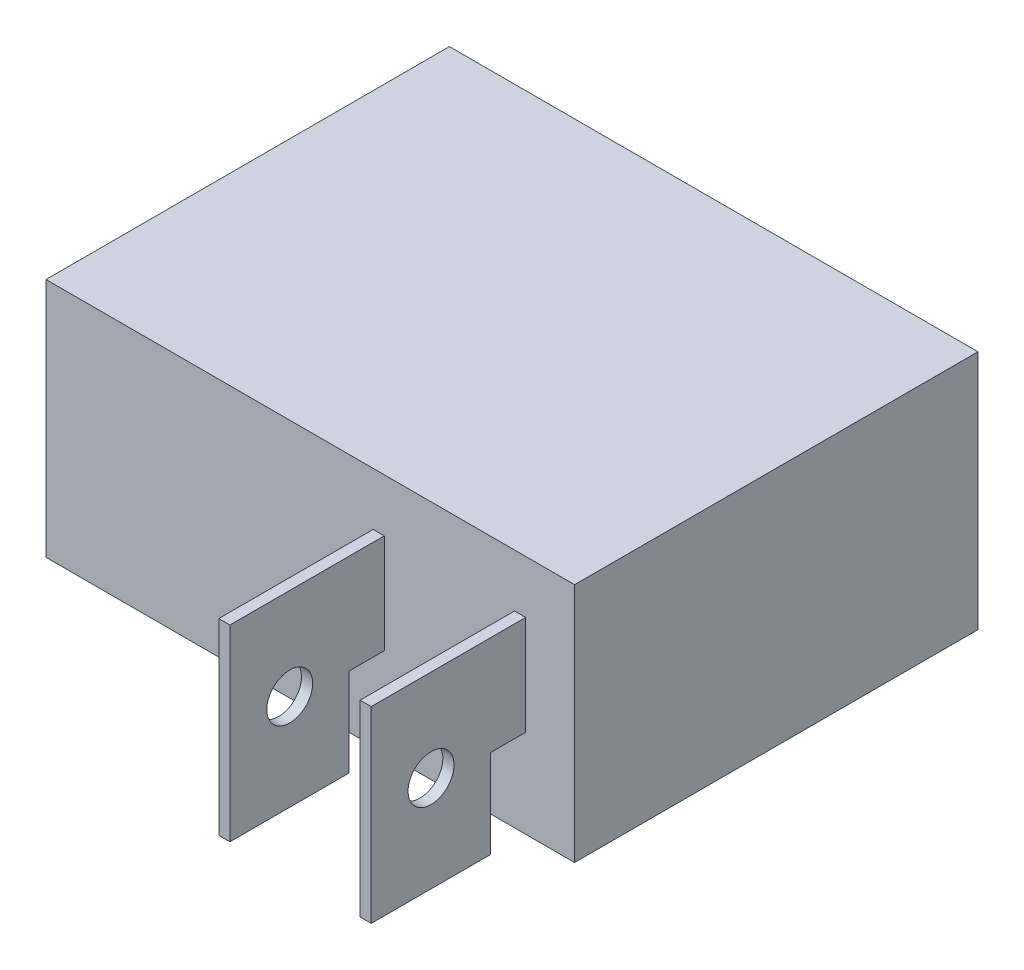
ISO-10303-21;
HEADER;
FILE_DESCRIPTION(('STEP AP214'),'2;1');
FILE_NAME('part.step','',(''),(''),'','','');
FILE_SCHEMA(('AUTOMOTIVE_DESIGN { 1 0 10303 214 1 1 1 1 }'));
ENDSEC;
DATA;
#1=APPLICATION_CONTEXT('core data for automotive mechanical design processes');
#2=APPLICATION_PROTOCOL_DEFINITION('international standard','automotive_design',2000,#1);
#3=PRODUCT_CONTEXT('',#1,'mechanical');
#4=PRODUCT('Part','Part','',(#3));
#5=PRODUCT_RELATED_PRODUCT_CATEGORY('part','',(#4));
#6=PRODUCT_DEFINITION_FORMATION('','',#4);
#7=PRODUCT_DEFINITION_CONTEXT('part definition',#1,'design');
#8=PRODUCT_DEFINITION('design','',#6,#7);
#9=PRODUCT_DEFINITION_SHAPE('','',#8);
#10=(LENGTH_UNIT() NAMED_UNIT(*) SI_UNIT(.MILLI.,.METRE.));
#11=(NAMED_UNIT(*) PLANE_ANGLE_UNIT() SI_UNIT($,.RADIAN.));
#12=(NAMED_UNIT(*) SI_UNIT($,.STERADIAN.) SOLID_ANGLE_UNIT());
#13=UNCERTAINTY_MEASURE_WITH_UNIT(LENGTH_MEASURE(1.E-05),#10,'distance_accuracy_value','');
#14=(GEOMETRIC_REPRESENTATION_CONTEXT(3) GLOBAL_UNCERTAINTY_ASSIGNED_CONTEXT((#13)) GLOBAL_UNIT_ASSIGNED_CONTEXT((#10,
#11,#12)) REPRESENTATION_CONTEXT('',''));
#15=CARTESIAN_POINT('',(0.,0.,0.));
#16=DIRECTION('',(0.,0.,1.));
#17=DIRECTION('',(1.,0.,0.));
#18=AXIS2_PLACEMENT_3D('',#15,#16,#17);
#19=CARTESIAN_POINT('',(-19.,17.3,14.5));
#20=DIRECTION('',(0.,0.,-1.));
#21=DIRECTION('',(-1.,0.,0.));
#22=AXIS2_PLACEMENT_3D('',#19,#20,#21);
#23=PLANE('',#22);
#24=DIRECTION('',(1.,0.,0.));
#25=VECTOR('',#24,1.);
#26=CARTESIAN_POINT('',(4.519999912,6.35,14.5));
#27=LINE('',#26,#25);
#28=CARTESIAN_POINT('',(4.519999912,6.35,14.5));
#29=VERTEX_POINT('',#28);
#30=CARTESIAN_POINT('',(5.319999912,6.35,14.5));
#31=VERTEX_POINT('',#30);
#32=EDGE_CURVE('E287',#29,#31,#27,.T.);
#33=ORIENTED_EDGE('',*,*,#32,.F.);
#34=DIRECTION('',(0.,-1.,0.));
#35=VECTOR('',#34,1.);
#36=CARTESIAN_POINT('',(4.519999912,13.5,14.5));
#37=LINE('',#36,#35);
#38=CARTESIAN_POINT('',(4.519999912,13.5,14.5));
#39=VERTEX_POINT('',#38);
#40=EDGE_CURVE('E230',#39,#29,#37,.T.);
#41=ORIENTED_EDGE('',*,*,#40,.F.);
#42=DIRECTION('',(1.,0.,0.));
#43=VECTOR('',#42,1.);
#44=CARTESIAN_POINT('',(4.519999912,13.5,14.5));
#45=LINE('',#44,#43);
#46=CARTESIAN_POINT('',(5.319999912,13.5,14.5));
#47=VERTEX_POINT('',#46);
#48=EDGE_CURVE('E251',#39,#47,#45,.T.);
#49=ORIENTED_EDGE('',*,*,#48,.T.);
#50=DIRECTION('',(0.,-1.,0.));
#51=VECTOR('',#50,1.);
#52=CARTESIAN_POINT('',(5.319999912,13.5,14.5));
#53=LINE('',#52,#51);
#54=EDGE_CURVE('E226',#47,#31,#53,.T.);
#55=ORIENTED_EDGE('',*,*,#54,.T.);
#56=EDGE_LOOP('',(#33,#41,#49,#55));
#57=FACE_BOUND('',#56,.T.);
#58=DIRECTION('',(1.,0.,0.));
#59=VECTOR('',#58,1.);
#60=CARTESIAN_POINT('',(-19.,0.,14.5));
#61=LINE('',#60,#59);
#62=CARTESIAN_POINT('',(-19.,0.,14.5));
#63=VERTEX_POINT('',#62);
#64=CARTESIAN_POINT('',(19.,0.,14.5));
#65=VERTEX_POINT('',#64);
#66=EDGE_CURVE('E297',#63,#65,#61,.T.);
#67=ORIENTED_EDGE('',*,*,#66,.T.);
#68=DIRECTION('',(0.,-1.,0.));
#69=VECTOR('',#68,1.);
#70=CARTESIAN_POINT('',(19.,17.3,14.5));
#71=LINE('',#70,#69);
#72=CARTESIAN_POINT('',(19.,17.3,14.5));
#73=VERTEX_POINT('',#72);
#74=EDGE_CURVE('E306',#73,#65,#71,.T.);
#75=ORIENTED_EDGE('',*,*,#74,.F.);
#76=DIRECTION('',(1.,0.,0.));
#77=VECTOR('',#76,1.);
#78=CARTESIAN_POINT('',(-19.,17.3,14.5));
#79=LINE('',#78,#77);
#80=CARTESIAN_POINT('',(-19.,17.3,14.5));
#81=VERTEX_POINT('',#80);
#82=EDGE_CURVE('E303',#81,#73,#79,.T.);
#83=ORIENTED_EDGE('',*,*,#82,.F.);
#84=DIRECTION('',(0.,-1.,0.));
#85=VECTOR('',#84,1.);
#86=CARTESIAN_POINT('',(-19.,17.3,14.5));
#87=LINE('',#86,#85);
#88=EDGE_CURVE('E321',#81,#63,#87,.T.);
#89=ORIENTED_EDGE('',*,*,#88,.T.);
#90=EDGE_LOOP('',(#67,#75,#83,#89));
#91=FACE_BOUND('',#90,.T.);
#92=DIRECTION('',(1.,0.,0.));
#93=VECTOR('',#92,1.);
#94=CARTESIAN_POINT('',(14.679999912,6.35,14.5));
#95=LINE('',#94,#93);
#96=CARTESIAN_POINT('',(14.679999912,6.35,14.5));
#97=VERTEX_POINT('',#96);
#98=CARTESIAN_POINT('',(15.479999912,6.35,14.5));
#99=VERTEX_POINT('',#98);
#100=EDGE_CURVE('E55',#97,#99,#95,.T.);
#101=ORIENTED_EDGE('',*,*,#100,.F.);
#102=DIRECTION('',(0.,-1.,0.));
#103=VECTOR('',#102,1.);
#104=CARTESIAN_POINT('',(14.679999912,13.5,14.5));
#105=LINE('',#104,#103);
#106=CARTESIAN_POINT('',(14.679999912,13.5,14.5));
#107=VERTEX_POINT('',#106);
#108=EDGE_CURVE('E159',#107,#97,#105,.T.);
#109=ORIENTED_EDGE('',*,*,#108,.F.);
#110=DIRECTION('',(1.,0.,0.));
#111=VECTOR('',#110,1.);
#112=CARTESIAN_POINT('',(14.679999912,13.5,14.5));
#113=LINE('',#112,#111);
#114=CARTESIAN_POINT('',(15.479999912,13.5,14.5));
#115=VERTEX_POINT('',#114);
#116=EDGE_CURVE('E188',#107,#115,#113,.T.);
#117=ORIENTED_EDGE('',*,*,#116,.T.);
#118=DIRECTION('',(0.,-1.,0.));
#119=VECTOR('',#118,1.);
#120=CARTESIAN_POINT('',(15.479999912,13.5,14.5));
#121=LINE('',#120,#119);
#122=EDGE_CURVE('E60',#115,#99,#121,.T.);
#123=ORIENTED_EDGE('',*,*,#122,.T.);
#124=EDGE_LOOP('',(#101,#109,#117,#123));
#125=FACE_BOUND('',#124,.T.);
#126=ADVANCED_FACE('F39',(#57,#91,#125),#23,.F.);
#127=CARTESIAN_POINT('',(19.,17.3,14.5));
#128=DIRECTION('',(-1.,0.,0.));
#129=DIRECTION('',(0.,0.,1.));
#130=AXIS2_PLACEMENT_3D('',#127,#128,#129);
#131=PLANE('',#130);
#132=DIRECTION('',(0.,0.,-1.));
#133=VECTOR('',#132,1.);
#134=CARTESIAN_POINT('',(19.,0.,14.5));
#135=LINE('',#134,#133);
#136=CARTESIAN_POINT('',(19.,0.,-14.5));
#137=VERTEX_POINT('',#136);
#138=EDGE_CURVE('E291',#65,#137,#135,.T.);
#139=ORIENTED_EDGE('',*,*,#138,.T.);
#140=DIRECTION('',(0.,-1.,0.));
#141=VECTOR('',#140,1.);
#142=CARTESIAN_POINT('',(19.,17.3,-14.5));
#143=LINE('',#142,#141);
#144=CARTESIAN_POINT('',(19.,17.3,-14.5));
#145=VERTEX_POINT('',#144);
#146=EDGE_CURVE('E11',#145,#137,#143,.T.);
#147=ORIENTED_EDGE('',*,*,#146,.F.);
#148=DIRECTION('',(0.,0.,-1.));
#149=VECTOR('',#148,1.);
#150=CARTESIAN_POINT('',(19.,17.3,14.5));
#151=LINE('',#150,#149);
#152=EDGE_CURVE('E292',#73,#145,#151,.T.);
#153=ORIENTED_EDGE('',*,*,#152,.F.);
#154=ORIENTED_EDGE('',*,*,#74,.T.);
#155=EDGE_LOOP('',(#139,#147,#153,#154));
#156=FACE_BOUND('',#155,.T.);
#157=ADVANCED_FACE('F41',(#156),#131,.F.);
#158=CARTESIAN_POINT('',(-19.,17.3,-14.5));
#159=DIRECTION('',(0.,0.,1.));
#160=DIRECTION('',(1.,0.,0.));
#161=AXIS2_PLACEMENT_3D('',#158,#159,#160);
#162=PLANE('',#161);
#163=DIRECTION('',(-1.,0.,0.));
#164=VECTOR('',#163,1.);
#165=CARTESIAN_POINT('',(-19.,0.,-14.5));
#166=LINE('',#165,#164);
#167=CARTESIAN_POINT('',(-19.,0.,-14.5));
#168=VERTEX_POINT('',#167);
#169=EDGE_CURVE('E310',#137,#168,#166,.T.);
#170=ORIENTED_EDGE('',*,*,#169,.T.);
#171=DIRECTION('',(0.,-1.,0.));
#172=VECTOR('',#171,1.);
#173=CARTESIAN_POINT('',(-19.,17.3,-14.5));
#174=LINE('',#173,#172);
#175=CARTESIAN_POINT('',(-19.,17.3,-14.5));
#176=VERTEX_POINT('',#175);
#177=EDGE_CURVE('E48',#176,#168,#174,.T.);
#178=ORIENTED_EDGE('',*,*,#177,.F.);
#179=DIRECTION('',(-1.,0.,0.));
#180=VECTOR('',#179,1.);
#181=CARTESIAN_POINT('',(-19.,17.3,-14.5));
#182=LINE('',#181,#180);
#183=EDGE_CURVE('E296',#145,#176,#182,.T.);
#184=ORIENTED_EDGE('',*,*,#183,.F.);
#185=ORIENTED_EDGE('',*,*,#146,.T.);
#186=EDGE_LOOP('',(#170,#178,#184,#185));
#187=FACE_BOUND('',#186,.T.);
#188=ADVANCED_FACE('F345',(#187),#162,.F.);
#189=CARTESIAN_POINT('',(-19.,17.3,14.5));
#190=DIRECTION('',(1.,0.,0.));
#191=DIRECTION('',(0.,0.,-1.));
#192=AXIS2_PLACEMENT_3D('',#189,#190,#191);
#193=PLANE('',#192);
#194=DIRECTION('',(0.,0.,1.));
#195=VECTOR('',#194,1.);
#196=CARTESIAN_POINT('',(-19.,0.,14.5));
#197=LINE('',#196,#195);
#198=EDGE_CURVE('E313',#168,#63,#197,.T.);
#199=ORIENTED_EDGE('',*,*,#198,.T.);
#200=ORIENTED_EDGE('',*,*,#88,.F.);
#201=DIRECTION('',(0.,0.,1.));
#202=VECTOR('',#201,1.);
#203=CARTESIAN_POINT('',(-19.,17.3,14.5));
#204=LINE('',#203,#202);
#205=EDGE_CURVE('E300',#176,#81,#204,.T.);
#206=ORIENTED_EDGE('',*,*,#205,.F.);
#207=ORIENTED_EDGE('',*,*,#177,.T.);
#208=EDGE_LOOP('',(#199,#200,#206,#207));
#209=FACE_BOUND('',#208,.T.);
#210=ADVANCED_FACE('F330',(#209),#193,.F.);
#211=CARTESIAN_POINT('',(0.,17.3,0.));
#212=DIRECTION('',(0.,-1.,0.));
#213=DIRECTION('',(0.,0.,-1.));
#214=AXIS2_PLACEMENT_3D('',#211,#212,#213);
#215=PLANE('',#214);
#216=ORIENTED_EDGE('',*,*,#152,.T.);
#217=ORIENTED_EDGE('',*,*,#183,.T.);
#218=ORIENTED_EDGE('',*,*,#205,.T.);
#219=ORIENTED_EDGE('',*,*,#82,.T.);
#220=EDGE_LOOP('',(#216,#217,#218,#219));
#221=FACE_BOUND('',#220,.T.);
#222=ADVANCED_FACE('F344',(#221),#215,.F.);
#223=CARTESIAN_POINT('',(0.,0.,0.));
#224=DIRECTION('',(0.,-1.,0.));
#225=DIRECTION('',(0.,0.,-1.));
#226=AXIS2_PLACEMENT_3D('',#223,#224,#225);
#227=PLANE('',#226);
#228=ORIENTED_EDGE('',*,*,#138,.F.);
#229=ORIENTED_EDGE('',*,*,#66,.F.);
#230=ORIENTED_EDGE('',*,*,#198,.F.);
#231=ORIENTED_EDGE('',*,*,#169,.F.);
#232=EDGE_LOOP('',(#228,#229,#230,#231));
#233=FACE_BOUND('',#232,.T.);
#234=ADVANCED_FACE('F336',(#233),#227,.T.);
#235=CARTESIAN_POINT('',(4.519999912,0.,0.));
#236=DIRECTION('',(1.,0.,0.));
#237=DIRECTION('',(0.,0.,-1.));
#238=AXIS2_PLACEMENT_3D('',#235,#236,#237);
#239=PLANE('',#238);
#240=ORIENTED_EDGE('',*,*,#40,.T.);
#241=DIRECTION('',(0.,0.,1.));
#242=VECTOR('',#241,1.);
#243=CARTESIAN_POINT('',(4.519999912,6.35,17.03));
#244=LINE('',#243,#242);
#245=CARTESIAN_POINT('',(4.519999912,6.35,17.03));
#246=VERTEX_POINT('',#245);
#247=EDGE_CURVE('E234',#29,#246,#244,.T.);
#248=ORIENTED_EDGE('',*,*,#247,.T.);
#249=DIRECTION('',(0.,-1.,0.));
#250=VECTOR('',#249,1.);
#251=CARTESIAN_POINT('',(4.519999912,0.,17.03));
#252=LINE('',#251,#250);
#253=CARTESIAN_POINT('',(4.519999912,0.,17.03));
#254=VERTEX_POINT('',#253);
#255=EDGE_CURVE('E238',#246,#254,#252,.T.);
#256=ORIENTED_EDGE('',*,*,#255,.T.);
#257=DIRECTION('',(0.,0.,1.));
#258=VECTOR('',#257,1.);
#259=CARTESIAN_POINT('',(4.519999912,0.,25.6));
#260=LINE('',#259,#258);
#261=CARTESIAN_POINT('',(4.519999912,0.,25.6));
#262=VERTEX_POINT('',#261);
#263=EDGE_CURVE('E241',#254,#262,#260,.T.);
#264=ORIENTED_EDGE('',*,*,#263,.T.);
#265=DIRECTION('',(0.,1.,0.));
#266=VECTOR('',#265,1.);
#267=CARTESIAN_POINT('',(4.519999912,13.5,25.6));
#268=LINE('',#267,#266);
#269=CARTESIAN_POINT('',(4.519999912,13.5,25.6));
#270=VERTEX_POINT('',#269);
#271=EDGE_CURVE('E244',#262,#270,#268,.T.);
#272=ORIENTED_EDGE('',*,*,#271,.T.);
#273=DIRECTION('',(0.,0.,-1.));
#274=VECTOR('',#273,1.);
#275=CARTESIAN_POINT('',(4.519999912,13.5,14.5));
#276=LINE('',#275,#274);
#277=EDGE_CURVE('E247',#270,#39,#276,.T.);
#278=ORIENTED_EDGE('',*,*,#277,.T.);
#279=EDGE_LOOP('',(#240,#248,#256,#264,#272,#278));
#280=FACE_BOUND('',#279,.T.);
#281=CARTESIAN_POINT('',(4.519999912,6.9,21.3));
#282=DIRECTION('',(-1.,0.,0.));
#283=DIRECTION('',(0.,0.,1.));
#284=AXIS2_PLACEMENT_3D('',#281,#282,#283);
#285=CIRCLE('',#284,1.65);
#286=CARTESIAN_POINT('',(4.519999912,6.9,22.95));
#287=VERTEX_POINT('',#286);
#288=EDGE_CURVE('E222',#287,#287,#285,.T.);
#289=ORIENTED_EDGE('',*,*,#288,.F.);
#290=EDGE_LOOP('',(#289));
#291=FACE_BOUND('',#290,.T.);
#292=ADVANCED_FACE('F362',(#280,#291),#239,.F.);
#293=CARTESIAN_POINT('',(5.319999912,0.,0.));
#294=DIRECTION('',(1.,0.,0.));
#295=DIRECTION('',(0.,0.,-1.));
#296=AXIS2_PLACEMENT_3D('',#293,#294,#295);
#297=PLANE('',#296);
#298=ORIENTED_EDGE('',*,*,#54,.F.);
#299=DIRECTION('',(0.,0.,-1.));
#300=VECTOR('',#299,1.);
#301=CARTESIAN_POINT('',(5.319999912,13.5,14.5));
#302=LINE('',#301,#300);
#303=CARTESIAN_POINT('',(5.319999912,13.5,25.6));
#304=VERTEX_POINT('',#303);
#305=EDGE_CURVE('E235',#304,#47,#302,.T.);
#306=ORIENTED_EDGE('',*,*,#305,.F.);
#307=DIRECTION('',(0.,1.,0.));
#308=VECTOR('',#307,1.);
#309=CARTESIAN_POINT('',(5.319999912,13.5,25.6));
#310=LINE('',#309,#308);
#311=CARTESIAN_POINT('',(5.319999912,0.,25.6));
#312=VERTEX_POINT('',#311);
#313=EDGE_CURVE('E263',#312,#304,#310,.T.);
#314=ORIENTED_EDGE('',*,*,#313,.F.);
#315=DIRECTION('',(0.,0.,1.));
#316=VECTOR('',#315,1.);
#317=CARTESIAN_POINT('',(5.319999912,0.,25.6));
#318=LINE('',#317,#316);
#319=CARTESIAN_POINT('',(5.319999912,0.,17.03));
#320=VERTEX_POINT('',#319);
#321=EDGE_CURVE('E260',#320,#312,#318,.T.);
#322=ORIENTED_EDGE('',*,*,#321,.F.);
#323=DIRECTION('',(0.,-1.,0.));
#324=VECTOR('',#323,1.);
#325=CARTESIAN_POINT('',(5.319999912,0.,17.03));
#326=LINE('',#325,#324);
#327=CARTESIAN_POINT('',(5.319999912,6.35,17.03));
#328=VERTEX_POINT('',#327);
#329=EDGE_CURVE('E257',#328,#320,#326,.T.);
#330=ORIENTED_EDGE('',*,*,#329,.F.);
#331=DIRECTION('',(0.,0.,1.));
#332=VECTOR('',#331,1.);
#333=CARTESIAN_POINT('',(5.319999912,6.35,17.03));
#334=LINE('',#333,#332);
#335=EDGE_CURVE('E254',#31,#328,#334,.T.);
#336=ORIENTED_EDGE('',*,*,#335,.F.);
#337=EDGE_LOOP('',(#298,#306,#314,#322,#330,#336));
#338=FACE_BOUND('',#337,.T.);
#339=CARTESIAN_POINT('',(5.319999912,6.9,21.3));
#340=DIRECTION('',(-1.,0.,0.));
#341=DIRECTION('',(0.,0.,1.));
#342=AXIS2_PLACEMENT_3D('',#339,#340,#341);
#343=CIRCLE('',#342,1.65);
#344=CARTESIAN_POINT('',(5.319999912,6.9,22.95));
#345=VERTEX_POINT('',#344);
#346=EDGE_CURVE('E221',#345,#345,#343,.T.);
#347=ORIENTED_EDGE('',*,*,#346,.T.);
#348=EDGE_LOOP('',(#347));
#349=FACE_BOUND('',#348,.T.);
#350=ADVANCED_FACE('F369',(#338,#349),#297,.T.);
#351=CARTESIAN_POINT('',(4.519999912,6.35,17.03));
#352=DIRECTION('',(0.,1.,0.));
#353=DIRECTION('',(0.,0.,1.));
#354=AXIS2_PLACEMENT_3D('',#351,#352,#353);
#355=PLANE('',#354);
#356=ORIENTED_EDGE('',*,*,#335,.T.);
#357=DIRECTION('',(1.,0.,0.));
#358=VECTOR('',#357,1.);
#359=CARTESIAN_POINT('',(4.519999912,6.35,17.03));
#360=LINE('',#359,#358);
#361=EDGE_CURVE('E283',#246,#328,#360,.T.);
#362=ORIENTED_EDGE('',*,*,#361,.F.);
#363=ORIENTED_EDGE('',*,*,#247,.F.);
#364=ORIENTED_EDGE('',*,*,#32,.T.);
#365=EDGE_LOOP('',(#356,#362,#363,#364));
#366=FACE_BOUND('',#365,.T.);
#367=ADVANCED_FACE('F365',(#366),#355,.F.);
#368=CARTESIAN_POINT('',(4.519999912,0.,17.03));
#369=DIRECTION('',(0.,0.,1.));
#370=DIRECTION('',(1.,0.,0.));
#371=AXIS2_PLACEMENT_3D('',#368,#369,#370);
#372=PLANE('',#371);
#373=ORIENTED_EDGE('',*,*,#329,.T.);
#374=DIRECTION('',(1.,0.,0.));
#375=VECTOR('',#374,1.);
#376=CARTESIAN_POINT('',(4.519999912,0.,17.03));
#377=LINE('',#376,#375);
#378=EDGE_CURVE('E279',#254,#320,#377,.T.);
#379=ORIENTED_EDGE('',*,*,#378,.F.);
#380=ORIENTED_EDGE('',*,*,#255,.F.);
#381=ORIENTED_EDGE('',*,*,#361,.T.);
#382=EDGE_LOOP('',(#373,#379,#380,#381));
#383=FACE_BOUND('',#382,.T.);
#384=ADVANCED_FACE('F368',(#383),#372,.F.);
#385=CARTESIAN_POINT('',(4.519999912,0.,25.6));
#386=DIRECTION('',(0.,1.,0.));
#387=DIRECTION('',(0.,0.,1.));
#388=AXIS2_PLACEMENT_3D('',#385,#386,#387);
#389=PLANE('',#388);
#390=ORIENTED_EDGE('',*,*,#321,.T.);
#391=DIRECTION('',(1.,0.,0.));
#392=VECTOR('',#391,1.);
#393=CARTESIAN_POINT('',(4.519999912,0.,25.6));
#394=LINE('',#393,#392);
#395=EDGE_CURVE('E275',#262,#312,#394,.T.);
#396=ORIENTED_EDGE('',*,*,#395,.F.);
#397=ORIENTED_EDGE('',*,*,#263,.F.);
#398=ORIENTED_EDGE('',*,*,#378,.T.);
#399=EDGE_LOOP('',(#390,#396,#397,#398));
#400=FACE_BOUND('',#399,.T.);
#401=ADVANCED_FACE('F373',(#400),#389,.F.);
#402=CARTESIAN_POINT('',(4.519999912,13.5,25.6));
#403=DIRECTION('',(0.,0.,-1.));
#404=DIRECTION('',(-1.,0.,0.));
#405=AXIS2_PLACEMENT_3D('',#402,#403,#404);
#406=PLANE('',#405);
#407=ORIENTED_EDGE('',*,*,#313,.T.);
#408=DIRECTION('',(1.,0.,0.));
#409=VECTOR('',#408,1.);
#410=CARTESIAN_POINT('',(4.519999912,13.5,25.6));
#411=LINE('',#410,#409);
#412=EDGE_CURVE('E271',#270,#304,#411,.T.);
#413=ORIENTED_EDGE('',*,*,#412,.F.);
#414=ORIENTED_EDGE('',*,*,#271,.F.);
#415=ORIENTED_EDGE('',*,*,#395,.T.);
#416=EDGE_LOOP('',(#407,#413,#414,#415));
#417=FACE_BOUND('',#416,.T.);
#418=ADVANCED_FACE('F377',(#417),#406,.F.);
#419=CARTESIAN_POINT('',(4.519999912,13.5,14.5));
#420=DIRECTION('',(0.,-1.,0.));
#421=DIRECTION('',(0.,0.,-1.));
#422=AXIS2_PLACEMENT_3D('',#419,#420,#421);
#423=PLANE('',#422);
#424=ORIENTED_EDGE('',*,*,#305,.T.);
#425=ORIENTED_EDGE('',*,*,#48,.F.);
#426=ORIENTED_EDGE('',*,*,#277,.F.);
#427=ORIENTED_EDGE('',*,*,#412,.T.);
#428=EDGE_LOOP('',(#424,#425,#426,#427));
#429=FACE_BOUND('',#428,.T.);
#430=ADVANCED_FACE('F381',(#429),#423,.F.);
#431=CARTESIAN_POINT('',(4.519999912,6.9,21.3));
#432=DIRECTION('',(1.,0.,0.));
#433=DIRECTION('',(0.,0.,-1.));
#434=AXIS2_PLACEMENT_3D('',#431,#432,#433);
#435=CYLINDRICAL_SURFACE('',#434,1.65);
#436=ORIENTED_EDGE('',*,*,#288,.T.);
#437=EDGE_LOOP('',(#436));
#438=FACE_BOUND('',#437,.T.);
#439=ORIENTED_EDGE('',*,*,#346,.F.);
#440=EDGE_LOOP('',(#439));
#441=FACE_BOUND('',#440,.T.);
#442=ADVANCED_FACE('F385',(#438,#441),#435,.F.);
#443=CARTESIAN_POINT('',(14.679999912,0.,0.));
#444=DIRECTION('',(1.,0.,0.));
#445=DIRECTION('',(0.,0.,-1.));
#446=AXIS2_PLACEMENT_3D('',#443,#444,#445);
#447=PLANE('',#446);
#448=ORIENTED_EDGE('',*,*,#108,.T.);
#449=DIRECTION('',(0.,0.,1.));
#450=VECTOR('',#449,1.);
#451=CARTESIAN_POINT('',(14.679999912,6.35,17.03));
#452=LINE('',#451,#450);
#453=CARTESIAN_POINT('',(14.679999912,6.35,17.03));
#454=VERTEX_POINT('',#453);
#455=EDGE_CURVE('E151',#97,#454,#452,.T.);
#456=ORIENTED_EDGE('',*,*,#455,.T.);
#457=DIRECTION('',(0.,-1.,0.));
#458=VECTOR('',#457,1.);
#459=CARTESIAN_POINT('',(14.679999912,0.,17.03));
#460=LINE('',#459,#458);
#461=CARTESIAN_POINT('',(14.679999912,0.,17.03));
#462=VERTEX_POINT('',#461);
#463=EDGE_CURVE('E156',#454,#462,#460,.T.);
#464=ORIENTED_EDGE('',*,*,#463,.T.);
#465=DIRECTION('',(0.,0.,1.));
#466=VECTOR('',#465,1.);
#467=CARTESIAN_POINT('',(14.679999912,0.,25.6));
#468=LINE('',#467,#466);
#469=CARTESIAN_POINT('',(14.679999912,0.,25.6));
#470=VERTEX_POINT('',#469);
#471=EDGE_CURVE('E176',#462,#470,#468,.T.);
#472=ORIENTED_EDGE('',*,*,#471,.T.);
#473=DIRECTION('',(0.,1.,0.));
#474=VECTOR('',#473,1.);
#475=CARTESIAN_POINT('',(14.679999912,13.5,25.6));
#476=LINE('',#475,#474);
#477=CARTESIAN_POINT('',(14.679999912,13.5,25.6));
#478=VERTEX_POINT('',#477);
#479=EDGE_CURVE('E179',#470,#478,#476,.T.);
#480=ORIENTED_EDGE('',*,*,#479,.T.);
#481=DIRECTION('',(0.,0.,-1.));
#482=VECTOR('',#481,1.);
#483=CARTESIAN_POINT('',(14.679999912,13.5,14.5));
#484=LINE('',#483,#482);
#485=EDGE_CURVE('E185',#478,#107,#484,.T.);
#486=ORIENTED_EDGE('',*,*,#485,.T.);
#487=EDGE_LOOP('',(#448,#456,#464,#472,#480,#486));
#488=FACE_BOUND('',#487,.T.);
#489=CARTESIAN_POINT('',(14.679999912,6.9,21.3));
#490=DIRECTION('',(-1.,0.,0.));
#491=DIRECTION('',(0.,0.,1.));
#492=AXIS2_PLACEMENT_3D('',#489,#490,#491);
#493=CIRCLE('',#492,1.65);
#494=CARTESIAN_POINT('',(14.679999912,6.9,22.95));
#495=VERTEX_POINT('',#494);
#496=EDGE_CURVE('E191',#495,#495,#493,.T.);
#497=ORIENTED_EDGE('',*,*,#496,.F.);
#498=EDGE_LOOP('',(#497));
#499=FACE_BOUND('',#498,.T.);
#500=ADVANCED_FACE('F153',(#488,#499),#447,.F.);
#501=CARTESIAN_POINT('',(15.479999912,0.,0.));
#502=DIRECTION('',(1.,0.,0.));
#503=DIRECTION('',(0.,0.,-1.));
#504=AXIS2_PLACEMENT_3D('',#501,#502,#503);
#505=PLANE('',#504);
#506=ORIENTED_EDGE('',*,*,#122,.F.);
#507=DIRECTION('',(0.,0.,-1.));
#508=VECTOR('',#507,1.);
#509=CARTESIAN_POINT('',(15.479999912,13.5,14.5));
#510=LINE('',#509,#508);
#511=CARTESIAN_POINT('',(15.479999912,13.5,25.6));
#512=VERTEX_POINT('',#511);
#513=EDGE_CURVE('E203',#512,#115,#510,.T.);
#514=ORIENTED_EDGE('',*,*,#513,.F.);
#515=DIRECTION('',(0.,1.,0.));
#516=VECTOR('',#515,1.);
#517=CARTESIAN_POINT('',(15.479999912,13.5,25.6));
#518=LINE('',#517,#516);
#519=CARTESIAN_POINT('',(15.479999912,0.,25.6));
#520=VERTEX_POINT('',#519);
#521=EDGE_CURVE('E200',#520,#512,#518,.T.);
#522=ORIENTED_EDGE('',*,*,#521,.F.);
#523=DIRECTION('',(0.,0.,1.));
#524=VECTOR('',#523,1.);
#525=CARTESIAN_POINT('',(15.479999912,0.,25.6));
#526=LINE('',#525,#524);
#527=CARTESIAN_POINT('',(15.479999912,0.,17.03));
#528=VERTEX_POINT('',#527);
#529=EDGE_CURVE('E197',#528,#520,#526,.T.);
#530=ORIENTED_EDGE('',*,*,#529,.F.);
#531=DIRECTION('',(0.,-1.,0.));
#532=VECTOR('',#531,1.);
#533=CARTESIAN_POINT('',(15.479999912,0.,17.03));
#534=LINE('',#533,#532);
#535=CARTESIAN_POINT('',(15.479999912,6.35,17.03));
#536=VERTEX_POINT('',#535);
#537=EDGE_CURVE('E194',#536,#528,#534,.T.);
#538=ORIENTED_EDGE('',*,*,#537,.F.);
#539=DIRECTION('',(0.,0.,1.));
#540=VECTOR('',#539,1.);
#541=CARTESIAN_POINT('',(15.479999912,6.35,17.03));
#542=LINE('',#541,#540);
#543=EDGE_CURVE('E166',#99,#536,#542,.T.);
#544=ORIENTED_EDGE('',*,*,#543,.F.);
#545=EDGE_LOOP('',(#506,#514,#522,#530,#538,#544));
#546=FACE_BOUND('',#545,.T.);
#547=CARTESIAN_POINT('',(15.479999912,6.9,21.3));
#548=DIRECTION('',(-1.,0.,0.));
#549=DIRECTION('',(0.,0.,1.));
#550=AXIS2_PLACEMENT_3D('',#547,#548,#549);
#551=CIRCLE('',#550,1.65);
#552=CARTESIAN_POINT('',(15.479999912,6.9,22.95));
#553=VERTEX_POINT('',#552);
#554=EDGE_CURVE('E428',#553,#553,#551,.T.);
#555=ORIENTED_EDGE('',*,*,#554,.T.);
#556=EDGE_LOOP('',(#555));
#557=FACE_BOUND('',#556,.T.);
#558=ADVANCED_FACE('F398',(#546,#557),#505,.T.);
#559=CARTESIAN_POINT('',(14.679999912,6.35,17.03));
#560=DIRECTION('',(0.,1.,0.));
#561=DIRECTION('',(0.,0.,1.));
#562=AXIS2_PLACEMENT_3D('',#559,#560,#561);
#563=PLANE('',#562);
#564=ORIENTED_EDGE('',*,*,#543,.T.);
#565=DIRECTION('',(1.,0.,0.));
#566=VECTOR('',#565,1.);
#567=CARTESIAN_POINT('',(14.679999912,6.35,17.03));
#568=LINE('',#567,#566);
#569=EDGE_CURVE('E164',#454,#536,#568,.T.);
#570=ORIENTED_EDGE('',*,*,#569,.F.);
#571=ORIENTED_EDGE('',*,*,#455,.F.);
#572=ORIENTED_EDGE('',*,*,#100,.T.);
#573=EDGE_LOOP('',(#564,#570,#571,#572));
#574=FACE_BOUND('',#573,.T.);
#575=ADVANCED_FACE('F165',(#574),#563,.F.);
#576=CARTESIAN_POINT('',(14.679999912,0.,17.03));
#577=DIRECTION('',(0.,0.,1.));
#578=DIRECTION('',(1.,0.,0.));
#579=AXIS2_PLACEMENT_3D('',#576,#577,#578);
#580=PLANE('',#579);
#581=ORIENTED_EDGE('',*,*,#537,.T.);
#582=DIRECTION('',(1.,0.,0.));
#583=VECTOR('',#582,1.);
#584=CARTESIAN_POINT('',(14.679999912,0.,17.03));
#585=LINE('',#584,#583);
#586=EDGE_CURVE('E170',#462,#528,#585,.T.);
#587=ORIENTED_EDGE('',*,*,#586,.F.);
#588=ORIENTED_EDGE('',*,*,#463,.F.);
#589=ORIENTED_EDGE('',*,*,#569,.T.);
#590=EDGE_LOOP('',(#581,#587,#588,#589));
#591=FACE_BOUND('',#590,.T.);
#592=ADVANCED_FACE('F172',(#591),#580,.F.);
#593=CARTESIAN_POINT('',(14.679999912,0.,25.6));
#594=DIRECTION('',(0.,1.,0.));
#595=DIRECTION('',(0.,0.,1.));
#596=AXIS2_PLACEMENT_3D('',#593,#594,#595);
#597=PLANE('',#596);
#598=ORIENTED_EDGE('',*,*,#529,.T.);
#599=DIRECTION('',(1.,0.,0.));
#600=VECTOR('',#599,1.);
#601=CARTESIAN_POINT('',(14.679999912,0.,25.6));
#602=LINE('',#601,#600);
#603=EDGE_CURVE('E213',#470,#520,#602,.T.);
#604=ORIENTED_EDGE('',*,*,#603,.F.);
#605=ORIENTED_EDGE('',*,*,#471,.F.);
#606=ORIENTED_EDGE('',*,*,#586,.T.);
#607=EDGE_LOOP('',(#598,#604,#605,#606));
#608=FACE_BOUND('',#607,.T.);
#609=ADVANCED_FACE('F401',(#608),#597,.F.);
#610=CARTESIAN_POINT('',(14.679999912,13.5,25.6));
#611=DIRECTION('',(0.,0.,-1.));
#612=DIRECTION('',(-1.,0.,0.));
#613=AXIS2_PLACEMENT_3D('',#610,#611,#612);
#614=PLANE('',#613);
#615=ORIENTED_EDGE('',*,*,#521,.T.);
#616=DIRECTION('',(1.,0.,0.));
#617=VECTOR('',#616,1.);
#618=CARTESIAN_POINT('',(14.679999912,13.5,25.6));
#619=LINE('',#618,#617);
#620=EDGE_CURVE('E209',#478,#512,#619,.T.);
#621=ORIENTED_EDGE('',*,*,#620,.F.);
#622=ORIENTED_EDGE('',*,*,#479,.F.);
#623=ORIENTED_EDGE('',*,*,#603,.T.);
#624=EDGE_LOOP('',(#615,#621,#622,#623));
#625=FACE_BOUND('',#624,.T.);
#626=ADVANCED_FACE('F404',(#625),#614,.F.);
#627=CARTESIAN_POINT('',(14.679999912,13.5,14.5));
#628=DIRECTION('',(0.,-1.,0.));
#629=DIRECTION('',(0.,0.,-1.));
#630=AXIS2_PLACEMENT_3D('',#627,#628,#629);
#631=PLANE('',#630);
#632=ORIENTED_EDGE('',*,*,#513,.T.);
#633=ORIENTED_EDGE('',*,*,#116,.F.);
#634=ORIENTED_EDGE('',*,*,#485,.F.);
#635=ORIENTED_EDGE('',*,*,#620,.T.);
#636=EDGE_LOOP('',(#632,#633,#634,#635));
#637=FACE_BOUND('',#636,.T.);
#638=ADVANCED_FACE('F408',(#637),#631,.F.);
#639=CARTESIAN_POINT('',(14.679999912,6.9,21.3));
#640=DIRECTION('',(1.,0.,0.));
#641=DIRECTION('',(0.,0.,-1.));
#642=AXIS2_PLACEMENT_3D('',#639,#640,#641);
#643=CYLINDRICAL_SURFACE('',#642,1.65);
#644=ORIENTED_EDGE('',*,*,#496,.T.);
#645=EDGE_LOOP('',(#644));
#646=FACE_BOUND('',#645,.T.);
#647=ORIENTED_EDGE('',*,*,#554,.F.);
#648=EDGE_LOOP('',(#647));
#649=FACE_BOUND('',#648,.T.);
#650=ADVANCED_FACE('F412',(#646,#649),#643,.F.);
#651=CLOSED_SHELL('',(#126,#157,#188,#210,#222,#234,#292,#350,#367,#384,#401,#418,#430,#442,
#500,#558,#575,#592,#609,#626,#638,#650));
#652=MANIFOLD_SOLID_BREP('B2',#651);
#653=ADVANCED_BREP_SHAPE_REPRESENTATION('',(#18,#652),#14);
#654=SHAPE_DEFINITION_REPRESENTATION(#9,#653);
ENDSEC;
END-ISO-10303-21;
